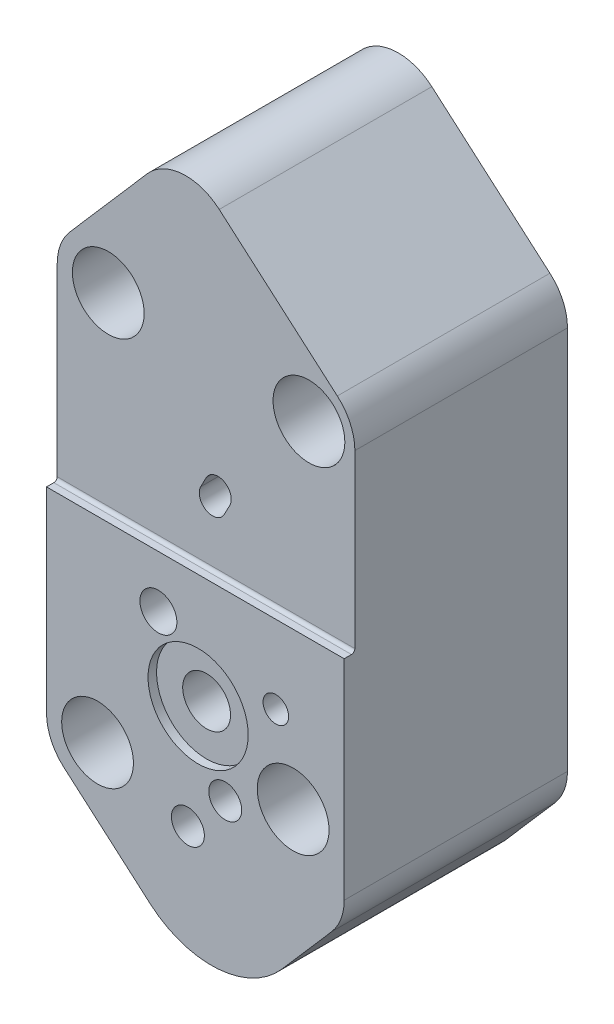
ISO-10303-21;
HEADER;
FILE_DESCRIPTION(('STEP AP214'),'2;1');
FILE_NAME('part.step','',(''),(''),'','','');
FILE_SCHEMA(('AUTOMOTIVE_DESIGN { 1 0 10303 214 1 1 1 1 }'));
ENDSEC;
DATA;
#1=APPLICATION_CONTEXT('core data for automotive mechanical design processes');
#2=APPLICATION_PROTOCOL_DEFINITION('international standard','automotive_design',2000,#1);
#3=PRODUCT_CONTEXT('',#1,'mechanical');
#4=PRODUCT('Part','Part','',(#3));
#5=PRODUCT_RELATED_PRODUCT_CATEGORY('part','',(#4));
#6=PRODUCT_DEFINITION_FORMATION('','',#4);
#7=PRODUCT_DEFINITION_CONTEXT('part definition',#1,'design');
#8=PRODUCT_DEFINITION('design','',#6,#7);
#9=PRODUCT_DEFINITION_SHAPE('','',#8);
#10=(LENGTH_UNIT() NAMED_UNIT(*) SI_UNIT(.MILLI.,.METRE.));
#11=(NAMED_UNIT(*) PLANE_ANGLE_UNIT() SI_UNIT($,.RADIAN.));
#12=(NAMED_UNIT(*) SI_UNIT($,.STERADIAN.) SOLID_ANGLE_UNIT());
#13=UNCERTAINTY_MEASURE_WITH_UNIT(LENGTH_MEASURE(1.E-05),#10,'distance_accuracy_value','');
#14=(GEOMETRIC_REPRESENTATION_CONTEXT(3) GLOBAL_UNCERTAINTY_ASSIGNED_CONTEXT((#13)) GLOBAL_UNIT_ASSIGNED_CONTEXT((#10,
#11,#12)) REPRESENTATION_CONTEXT('',''));
#15=CARTESIAN_POINT('',(0.,0.,0.));
#16=DIRECTION('',(0.,0.,1.));
#17=DIRECTION('',(1.,0.,0.));
#18=AXIS2_PLACEMENT_3D('',#15,#16,#17);
#19=CARTESIAN_POINT('',(-786.638,12.1965232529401,1.5998698));
#20=DIRECTION('',(0.,0.,-1.));
#21=DIRECTION('',(-1.,0.,0.));
#22=AXIS2_PLACEMENT_3D('',#19,#20,#21);
#23=CYLINDRICAL_SURFACE('',#22,7.61999999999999);
#24=CARTESIAN_POINT('',(-786.638,12.1965232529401,0.));
#25=DIRECTION('',(0.,0.,1.));
#26=DIRECTION('',(1.,0.,0.));
#27=AXIS2_PLACEMENT_3D('',#24,#25,#26);
#28=CIRCLE('',#27,7.61999999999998);
#29=CARTESIAN_POINT('',(-781.641641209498,17.9498526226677,0.));
#30=VERTEX_POINT('',#29);
#31=CARTESIAN_POINT('',(-779.018,12.1965232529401,0.));
#32=VERTEX_POINT('',#31);
#33=EDGE_CURVE('E385',#30,#32,#28,.F.);
#34=ORIENTED_EDGE('',*,*,#33,.T.);
#35=DIRECTION('',(0.,0.,-1.));
#36=VECTOR('',#35,1.);
#37=CARTESIAN_POINT('',(-779.018,12.1965232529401,1.5998698));
#38=LINE('',#37,#36);
#39=CARTESIAN_POINT('',(-779.018,12.1965232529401,-31.75));
#40=VERTEX_POINT('',#39);
#41=EDGE_CURVE('E247',#32,#40,#38,.T.);
#42=ORIENTED_EDGE('',*,*,#41,.T.);
#43=CARTESIAN_POINT('',(-786.638,12.1965232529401,-31.75));
#44=DIRECTION('',(0.,0.,1.));
#45=DIRECTION('',(1.,0.,0.));
#46=AXIS2_PLACEMENT_3D('',#43,#44,#45);
#47=CIRCLE('',#46,7.61999999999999);
#48=CARTESIAN_POINT('',(-781.641641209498,17.9498526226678,-31.75));
#49=VERTEX_POINT('',#48);
#50=EDGE_CURVE('E601',#40,#49,#47,.T.);
#51=ORIENTED_EDGE('',*,*,#50,.T.);
#52=DIRECTION('',(0.,0.,-1.));
#53=VECTOR('',#52,1.);
#54=CARTESIAN_POINT('',(-781.641641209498,17.9498526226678,1.5998698));
#55=LINE('',#54,#53);
#56=EDGE_CURVE('E244',#30,#49,#55,.T.);
#57=ORIENTED_EDGE('',*,*,#56,.F.);
#58=EDGE_LOOP('',(#34,#42,#51,#57));
#59=FACE_BOUND('',#58,.T.);
#60=ADVANCED_FACE('F51',(#59),#23,.T.);
#61=CARTESIAN_POINT('',(-799.2745235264,33.2627611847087,1.5998698));
#62=DIRECTION('',(-0.65569012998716,-0.755030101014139,0.));
#63=DIRECTION('',(0.755030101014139,-0.65569012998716,0.));
#64=AXIS2_PLACEMENT_3D('',#61,#62,#63);
#65=PLANE('',#64);
#66=DIRECTION('',(0.75503010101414,-0.65569012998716,0.));
#67=VECTOR('',#66,1.);
#68=CARTESIAN_POINT('',(-781.641641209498,17.9498526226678,0.));
#69=LINE('',#68,#67);
#70=CARTESIAN_POINT('',(-799.2745235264,33.2627611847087,0.));
#71=VERTEX_POINT('',#70);
#72=EDGE_CURVE('E389',#71,#30,#69,.T.);
#73=ORIENTED_EDGE('',*,*,#72,.T.);
#74=ORIENTED_EDGE('',*,*,#56,.T.);
#75=DIRECTION('',(-0.755030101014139,0.65569012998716,0.));
#76=VECTOR('',#75,1.);
#77=CARTESIAN_POINT('',(-799.2745235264,33.2627611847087,-31.75));
#78=LINE('',#77,#76);
#79=CARTESIAN_POINT('',(-799.2745235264,33.2627611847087,-31.75));
#80=VERTEX_POINT('',#79);
#81=EDGE_CURVE('E605',#49,#80,#78,.T.);
#82=ORIENTED_EDGE('',*,*,#81,.T.);
#83=DIRECTION('',(0.,0.,-1.));
#84=VECTOR('',#83,1.);
#85=CARTESIAN_POINT('',(-799.2745235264,33.2627611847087,1.5998698));
#86=LINE('',#85,#84);
#87=EDGE_CURVE('E241',#71,#80,#86,.T.);
#88=ORIENTED_EDGE('',*,*,#87,.F.);
#89=EDGE_LOOP('',(#73,#74,#82,#88));
#90=FACE_BOUND('',#89,.T.);
#91=ADVANCED_FACE('F545',(#90),#65,.F.);
#92=CARTESIAN_POINT('',(-804.270882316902,27.509431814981,1.5998698));
#93=DIRECTION('',(0.,0.,-1.));
#94=DIRECTION('',(-1.,0.,0.));
#95=AXIS2_PLACEMENT_3D('',#92,#93,#94);
#96=CYLINDRICAL_SURFACE('',#95,7.62);
#97=CARTESIAN_POINT('',(-804.270882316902,27.509431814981,0.));
#98=DIRECTION('',(0.,0.,1.));
#99=DIRECTION('',(1.,0.,0.));
#100=AXIS2_PLACEMENT_3D('',#97,#98,#99);
#101=CIRCLE('',#100,7.62);
#102=CARTESIAN_POINT('',(-810.02421168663,32.5057906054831,0.));
#103=VERTEX_POINT('',#102);
#104=EDGE_CURVE('E393',#103,#71,#101,.F.);
#105=ORIENTED_EDGE('',*,*,#104,.T.);
#106=ORIENTED_EDGE('',*,*,#87,.T.);
#107=CARTESIAN_POINT('',(-804.270882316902,27.509431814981,-31.75));
#108=DIRECTION('',(0.,0.,1.));
#109=DIRECTION('',(-1.,0.,0.));
#110=AXIS2_PLACEMENT_3D('',#107,#108,#109);
#111=CIRCLE('',#110,7.62);
#112=CARTESIAN_POINT('',(-810.02421168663,32.5057906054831,-31.75));
#113=VERTEX_POINT('',#112);
#114=EDGE_CURVE('E613',#80,#113,#111,.T.);
#115=ORIENTED_EDGE('',*,*,#114,.T.);
#116=DIRECTION('',(0.,0.,-1.));
#117=VECTOR('',#116,1.);
#118=CARTESIAN_POINT('',(-810.02421168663,32.5057906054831,1.5998698));
#119=LINE('',#118,#117);
#120=EDGE_CURVE('E238',#103,#113,#119,.T.);
#121=ORIENTED_EDGE('',*,*,#120,.F.);
#122=EDGE_LOOP('',(#105,#106,#115,#121));
#123=FACE_BOUND('',#122,.T.);
#124=ADVANCED_FACE('F552',(#123),#96,.T.);
#125=CARTESIAN_POINT('',(-810.02421168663,32.5057906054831,1.5998698));
#126=DIRECTION('',(0.75503010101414,-0.655690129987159,0.));
#127=DIRECTION('',(0.655690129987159,0.75503010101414,0.));
#128=AXIS2_PLACEMENT_3D('',#125,#126,#127);
#129=PLANE('',#128);
#130=DIRECTION('',(0.655690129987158,0.755030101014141,0.));
#131=VECTOR('',#130,1.);
#132=CARTESIAN_POINT('',(-810.02421168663,32.5057906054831,0.));
#133=LINE('',#132,#131);
#134=CARTESIAN_POINT('',(-821.601329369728,19.1746881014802,0.));
#135=VERTEX_POINT('',#134);
#136=EDGE_CURVE('E397',#135,#103,#133,.T.);
#137=ORIENTED_EDGE('',*,*,#136,.T.);
#138=ORIENTED_EDGE('',*,*,#120,.T.);
#139=DIRECTION('',(-0.655690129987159,-0.75503010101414,0.));
#140=VECTOR('',#139,1.);
#141=CARTESIAN_POINT('',(-810.02421168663,32.5057906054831,-31.75));
#142=LINE('',#141,#140);
#143=CARTESIAN_POINT('',(-821.601329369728,19.1746881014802,-31.75));
#144=VERTEX_POINT('',#143);
#145=EDGE_CURVE('E619',#113,#144,#142,.T.);
#146=ORIENTED_EDGE('',*,*,#145,.T.);
#147=DIRECTION('',(0.,0.,-1.));
#148=VECTOR('',#147,1.);
#149=CARTESIAN_POINT('',(-821.601329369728,19.1746881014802,1.5998698));
#150=LINE('',#149,#148);
#151=EDGE_CURVE('E235',#135,#144,#150,.T.);
#152=ORIENTED_EDGE('',*,*,#151,.F.);
#153=EDGE_LOOP('',(#137,#138,#146,#152));
#154=FACE_BOUND('',#153,.T.);
#155=ADVANCED_FACE('F727',(#154),#129,.F.);
#156=CARTESIAN_POINT('',(-815.848,14.178329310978,1.5998698));
#157=DIRECTION('',(0.,0.,-1.));
#158=DIRECTION('',(-1.,0.,0.));
#159=AXIS2_PLACEMENT_3D('',#156,#157,#158);
#160=CYLINDRICAL_SURFACE('',#159,7.61999999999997);
#161=CARTESIAN_POINT('',(-815.848,14.178329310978,0.));
#162=DIRECTION('',(0.,0.,1.));
#163=DIRECTION('',(1.,0.,0.));
#164=AXIS2_PLACEMENT_3D('',#161,#162,#163);
#165=CIRCLE('',#164,7.61999999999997);
#166=CARTESIAN_POINT('',(-823.468,14.178329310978,0.));
#167=VERTEX_POINT('',#166);
#168=EDGE_CURVE('E401',#167,#135,#165,.F.);
#169=ORIENTED_EDGE('',*,*,#168,.T.);
#170=ORIENTED_EDGE('',*,*,#151,.T.);
#171=CARTESIAN_POINT('',(-815.848,14.178329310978,-31.75));
#172=DIRECTION('',(0.,0.,1.));
#173=DIRECTION('',(-1.,0.,0.));
#174=AXIS2_PLACEMENT_3D('',#171,#172,#173);
#175=CIRCLE('',#174,7.61999999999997);
#176=CARTESIAN_POINT('',(-823.468,14.178329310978,-31.75));
#177=VERTEX_POINT('',#176);
#178=EDGE_CURVE('E628',#144,#177,#175,.T.);
#179=ORIENTED_EDGE('',*,*,#178,.T.);
#180=DIRECTION('',(0.,0.,-1.));
#181=VECTOR('',#180,1.);
#182=CARTESIAN_POINT('',(-823.468,14.178329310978,1.5998698));
#183=LINE('',#182,#181);
#184=EDGE_CURVE('E227',#167,#177,#183,.T.);
#185=ORIENTED_EDGE('',*,*,#184,.F.);
#186=EDGE_LOOP('',(#169,#170,#179,#185));
#187=FACE_BOUND('',#186,.T.);
#188=ADVANCED_FACE('F723',(#187),#160,.T.);
#189=CARTESIAN_POINT('',(-800.276606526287,-4.8861439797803,1.5998698));
#190=DIRECTION('',(0.,0.,-1.));
#191=DIRECTION('',(-1.,0.,0.));
#192=AXIS2_PLACEMENT_3D('',#189,#190,#191);
#193=CYLINDRICAL_SURFACE('',#192,1.98313999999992);
#194=DIRECTION('',(0.,0.,-1.));
#195=VECTOR('',#194,1.);
#196=CARTESIAN_POINT('',(-802.03634480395,-3.97172315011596,1.5998698));
#197=LINE('',#196,#195);
#198=CARTESIAN_POINT('',(-802.03634480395,-3.97172315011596,0.));
#199=VERTEX_POINT('',#198);
#200=CARTESIAN_POINT('',(-802.03634480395,-3.97172315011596,-6.35));
#201=VERTEX_POINT('',#200);
#202=EDGE_CURVE('E278',#199,#201,#197,.T.);
#203=ORIENTED_EDGE('',*,*,#202,.F.);
#204=CARTESIAN_POINT('',(-800.276606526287,-4.8861439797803,0.));
#205=DIRECTION('',(0.,0.,1.));
#206=DIRECTION('',(1.,0.,0.));
#207=AXIS2_PLACEMENT_3D('',#204,#205,#206);
#208=CIRCLE('',#207,1.98313999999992);
#209=CARTESIAN_POINT('',(-798.516868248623,-5.8005648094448,0.));
#210=VERTEX_POINT('',#209);
#211=EDGE_CURVE('E418',#199,#210,#208,.T.);
#212=ORIENTED_EDGE('',*,*,#211,.T.);
#213=DIRECTION('',(0.,0.,-1.));
#214=VECTOR('',#213,1.);
#215=CARTESIAN_POINT('',(-798.516868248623,-5.8005648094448,1.5998698));
#216=LINE('',#215,#214);
#217=CARTESIAN_POINT('',(-798.516868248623,-5.8005648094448,-6.35));
#218=VERTEX_POINT('',#217);
#219=EDGE_CURVE('E439',#210,#218,#216,.T.);
#220=ORIENTED_EDGE('',*,*,#219,.T.);
#221=CARTESIAN_POINT('',(-800.276606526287,-4.8861439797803,-6.35));
#222=DIRECTION('',(0.,0.,1.));
#223=DIRECTION('',(1.,0.,0.));
#224=AXIS2_PLACEMENT_3D('',#221,#222,#223);
#225=CIRCLE('',#224,1.98313999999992);
#226=EDGE_CURVE('E442',#201,#218,#225,.T.);
#227=ORIENTED_EDGE('',*,*,#226,.F.);
#228=EDGE_LOOP('',(#203,#212,#220,#227));
#229=FACE_BOUND('',#228,.T.);
#230=ADVANCED_FACE('F726',(#229),#193,.F.);
#231=CARTESIAN_POINT('',(-798.516868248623,-5.8005648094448,1.5998698));
#232=DIRECTION('',(-0.887349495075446,0.46109746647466,0.));
#233=DIRECTION('',(-0.46109746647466,-0.887349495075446,0.));
#234=AXIS2_PLACEMENT_3D('',#231,#232,#233);
#235=PLANE('',#234);
#236=ORIENTED_EDGE('',*,*,#219,.F.);
#237=DIRECTION('',(0.46109746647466,0.887349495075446,0.));
#238=VECTOR('',#237,1.);
#239=CARTESIAN_POINT('',(-798.516868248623,-5.8005648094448,0.));
#240=LINE('',#239,#238);
#241=CARTESIAN_POINT('',(-797.709947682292,-4.24770319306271,0.));
#242=VERTEX_POINT('',#241);
#243=EDGE_CURVE('E414',#210,#242,#240,.T.);
#244=ORIENTED_EDGE('',*,*,#243,.T.);
#245=DIRECTION('',(0.,0.,-1.));
#246=VECTOR('',#245,1.);
#247=CARTESIAN_POINT('',(-797.709947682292,-4.24770319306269,1.5998698));
#248=LINE('',#247,#246);
#249=CARTESIAN_POINT('',(-797.709947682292,-4.24770319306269,-6.35));
#250=VERTEX_POINT('',#249);
#251=EDGE_CURVE('E436',#242,#250,#248,.T.);
#252=ORIENTED_EDGE('',*,*,#251,.T.);
#253=DIRECTION('',(0.46109746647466,0.887349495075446,0.));
#254=VECTOR('',#253,1.);
#255=CARTESIAN_POINT('',(-798.516868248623,-5.8005648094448,-6.35));
#256=LINE('',#255,#254);
#257=EDGE_CURVE('E446',#218,#250,#256,.T.);
#258=ORIENTED_EDGE('',*,*,#257,.F.);
#259=EDGE_LOOP('',(#236,#244,#252,#258));
#260=FACE_BOUND('',#259,.T.);
#261=ADVANCED_FACE('F763',(#260),#235,.T.);
#262=CARTESIAN_POINT('',(-799.469685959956,-3.33328236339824,1.5998698));
#263=DIRECTION('',(0.,0.,-1.));
#264=DIRECTION('',(-1.,0.,0.));
#265=AXIS2_PLACEMENT_3D('',#262,#263,#264);
#266=CYLINDRICAL_SURFACE('',#265,1.98314000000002);
#267=ORIENTED_EDGE('',*,*,#251,.F.);
#268=CARTESIAN_POINT('',(-799.469685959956,-3.33328236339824,0.));
#269=DIRECTION('',(0.,0.,1.));
#270=DIRECTION('',(1.,0.,0.));
#271=AXIS2_PLACEMENT_3D('',#268,#269,#270);
#272=CIRCLE('',#271,1.98314000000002);
#273=CARTESIAN_POINT('',(-801.22942423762,-2.41886153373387,0.));
#274=VERTEX_POINT('',#273);
#275=EDGE_CURVE('E407',#242,#274,#272,.T.);
#276=ORIENTED_EDGE('',*,*,#275,.T.);
#277=DIRECTION('',(0.,0.,-1.));
#278=VECTOR('',#277,1.);
#279=CARTESIAN_POINT('',(-801.22942423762,-2.41886153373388,1.5998698));
#280=LINE('',#279,#278);
#281=CARTESIAN_POINT('',(-801.22942423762,-2.41886153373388,-6.35));
#282=VERTEX_POINT('',#281);
#283=EDGE_CURVE('E433',#274,#282,#280,.T.);
#284=ORIENTED_EDGE('',*,*,#283,.T.);
#285=CARTESIAN_POINT('',(-799.469685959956,-3.33328236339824,-6.35));
#286=DIRECTION('',(0.,0.,1.));
#287=DIRECTION('',(1.,0.,0.));
#288=AXIS2_PLACEMENT_3D('',#285,#286,#287);
#289=CIRCLE('',#288,1.98314000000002);
#290=EDGE_CURVE('E450',#250,#282,#289,.T.);
#291=ORIENTED_EDGE('',*,*,#290,.F.);
#292=EDGE_LOOP('',(#267,#276,#284,#291));
#293=FACE_BOUND('',#292,.T.);
#294=ADVANCED_FACE('F771',(#293),#266,.F.);
#295=CARTESIAN_POINT('',(-801.22942423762,-2.41886153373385,1.5998698));
#296=DIRECTION('',(0.887349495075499,-0.461097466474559,0.));
#297=DIRECTION('',(0.46109746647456,0.887349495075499,0.));
#298=AXIS2_PLACEMENT_3D('',#295,#296,#297);
#299=PLANE('',#298);
#300=ORIENTED_EDGE('',*,*,#283,.F.);
#301=DIRECTION('',(-0.46109746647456,-0.887349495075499,0.));
#302=VECTOR('',#301,1.);
#303=CARTESIAN_POINT('',(-801.22942423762,-2.41886153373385,0.));
#304=LINE('',#303,#302);
#305=EDGE_CURVE('E265',#274,#199,#304,.T.);
#306=ORIENTED_EDGE('',*,*,#305,.T.);
#307=ORIENTED_EDGE('',*,*,#202,.T.);
#308=DIRECTION('',(-0.461097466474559,-0.887349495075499,0.));
#309=VECTOR('',#308,1.);
#310=CARTESIAN_POINT('',(-801.22942423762,-2.41886153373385,-6.35));
#311=LINE('',#310,#309);
#312=EDGE_CURVE('E454',#282,#201,#311,.T.);
#313=ORIENTED_EDGE('',*,*,#312,.F.);
#314=EDGE_LOOP('',(#300,#306,#307,#313));
#315=FACE_BOUND('',#314,.T.);
#316=ADVANCED_FACE('F520',(#315),#299,.T.);
#317=CARTESIAN_POINT('',(-815.848,-43.1751649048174,1.5998698));
#318=DIRECTION('',(0.,0.,1.));
#319=DIRECTION('',(1.,0.,0.));
#320=AXIS2_PLACEMENT_3D('',#317,#318,#319);
#321=PLANE('',#320);
#322=CARTESIAN_POINT('',(-815.848,-43.1751649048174,1.5998698));
#323=DIRECTION('',(0.,0.,-1.));
#324=DIRECTION('',(-1.,0.,0.));
#325=AXIS2_PLACEMENT_3D('',#322,#323,#324);
#326=CIRCLE('',#325,5.3594);
#327=CARTESIAN_POINT('',(-821.2074,-43.1751649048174,1.5998698));
#328=VERTEX_POINT('',#327);
#329=EDGE_CURVE('E334',#328,#328,#326,.T.);
#330=ORIENTED_EDGE('',*,*,#329,.T.);
#331=EDGE_LOOP('',(#330));
#332=FACE_BOUND('',#331,.T.);
#333=CARTESIAN_POINT('',(-786.638,-37.2194709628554,1.5998698));
#334=DIRECTION('',(0.,0.,-1.));
#335=DIRECTION('',(-1.,0.,0.));
#336=AXIS2_PLACEMENT_3D('',#333,#334,#335);
#337=CIRCLE('',#336,5.3594);
#338=CARTESIAN_POINT('',(-791.9974,-37.2194709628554,1.5998698));
#339=VERTEX_POINT('',#338);
#340=EDGE_CURVE('E329',#339,#339,#337,.T.);
#341=ORIENTED_EDGE('',*,*,#340,.T.);
#342=EDGE_LOOP('',(#341));
#343=FACE_BOUND('',#342,.T.);
#344=DIRECTION('',(1.,0.,0.));
#345=VECTOR('',#344,1.);
#346=CARTESIAN_POINT('',(-823.468,-13.9178402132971,1.5998698));
#347=LINE('',#346,#345);
#348=CARTESIAN_POINT('',(-823.468,-13.9178402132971,1.5998698));
#349=VERTEX_POINT('',#348);
#350=CARTESIAN_POINT('',(-779.018,-13.9178402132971,1.5998698));
#351=VERTEX_POINT('',#350);
#352=EDGE_CURVE('E199',#349,#351,#347,.T.);
#353=ORIENTED_EDGE('',*,*,#352,.F.);
#354=DIRECTION('',(0.,-1.,0.));
#355=VECTOR('',#354,1.);
#356=CARTESIAN_POINT('',(-823.468,14.178329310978,1.5998698));
#357=LINE('',#356,#355);
#358=CARTESIAN_POINT('',(-823.468,-43.1751649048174,1.5998698));
#359=VERTEX_POINT('',#358);
#360=EDGE_CURVE('E211',#349,#359,#357,.T.);
#361=ORIENTED_EDGE('',*,*,#360,.T.);
#362=CARTESIAN_POINT('',(-815.848,-43.1751649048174,1.5998698));
#363=DIRECTION('',(0.,0.,1.));
#364=DIRECTION('',(1.,0.,0.));
#365=AXIS2_PLACEMENT_3D('',#362,#363,#364);
#366=CIRCLE('',#365,7.61999999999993);
#367=CARTESIAN_POINT('',(-820.844358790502,-48.9284942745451,1.5998698));
#368=VERTEX_POINT('',#367);
#369=EDGE_CURVE('E635',#359,#368,#366,.T.);
#370=ORIENTED_EDGE('',*,*,#369,.T.);
#371=DIRECTION('',(0.75503010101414,-0.655690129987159,0.));
#372=VECTOR('',#371,1.);
#373=CARTESIAN_POINT('',(-820.844358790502,-48.9284942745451,1.5998698));
#374=LINE('',#373,#372);
#375=CARTESIAN_POINT('',(-808.005917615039,-60.0777705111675,1.5998698));
#376=VERTEX_POINT('',#375);
#377=EDGE_CURVE('E638',#368,#376,#374,.T.);
#378=ORIENTED_EDGE('',*,*,#377,.T.);
#379=CARTESIAN_POINT('',(-798.845926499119,-49.53,1.5998698));
#380=DIRECTION('',(0.,0.,1.));
#381=DIRECTION('',(-1.,0.,0.));
#382=AXIS2_PLACEMENT_3D('',#379,#380,#381);
#383=CIRCLE('',#382,13.97);
#384=CARTESIAN_POINT('',(-788.298155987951,-58.6899911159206,1.5998698));
#385=VERTEX_POINT('',#384);
#386=EDGE_CURVE('E641',#376,#385,#383,.T.);
#387=ORIENTED_EDGE('',*,*,#386,.T.);
#388=DIRECTION('',(0.655690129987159,0.75503010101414,0.));
#389=VECTOR('',#388,1.);
#390=CARTESIAN_POINT('',(-780.884670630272,-50.1533297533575,1.5998698));
#391=LINE('',#390,#389);
#392=CARTESIAN_POINT('',(-780.884670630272,-50.1533297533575,1.5998698));
#393=VERTEX_POINT('',#392);
#394=EDGE_CURVE('E644',#385,#393,#391,.T.);
#395=ORIENTED_EDGE('',*,*,#394,.T.);
#396=CARTESIAN_POINT('',(-786.638,-45.1569709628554,1.5998698));
#397=DIRECTION('',(0.,0.,1.));
#398=DIRECTION('',(1.,0.,0.));
#399=AXIS2_PLACEMENT_3D('',#396,#397,#398);
#400=CIRCLE('',#399,7.61999999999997);
#401=CARTESIAN_POINT('',(-779.018,-45.1569709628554,1.5998698));
#402=VERTEX_POINT('',#401);
#403=EDGE_CURVE('E229',#393,#402,#400,.T.);
#404=ORIENTED_EDGE('',*,*,#403,.T.);
#405=DIRECTION('',(0.,1.,0.));
#406=VECTOR('',#405,1.);
#407=CARTESIAN_POINT('',(-779.018,12.1965232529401,1.5998698));
#408=LINE('',#407,#406);
#409=EDGE_CURVE('E214',#402,#351,#408,.T.);
#410=ORIENTED_EDGE('',*,*,#409,.T.);
#411=EDGE_LOOP('',(#353,#361,#370,#378,#387,#395,#404,#410));
#412=FACE_BOUND('',#411,.T.);
#413=CARTESIAN_POINT('',(-800.829795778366,-30.9504062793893,1.5998698));
#414=DIRECTION('',(0.,0.,1.));
#415=DIRECTION('',(1.,0.,0.));
#416=AXIS2_PLACEMENT_3D('',#413,#414,#415);
#417=CIRCLE('',#416,7.477125);
#418=CARTESIAN_POINT('',(-793.352670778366,-30.9504062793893,1.5998698));
#419=VERTEX_POINT('',#418);
#420=EDGE_CURVE('E274',#419,#419,#417,.T.);
#421=ORIENTED_EDGE('',*,*,#420,.F.);
#422=EDGE_LOOP('',(#421));
#423=FACE_BOUND('',#422,.T.);
#424=CARTESIAN_POINT('',(-796.778000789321,-41.1769872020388,1.5998698));
#425=DIRECTION('',(0.,0.,1.));
#426=DIRECTION('',(1.,0.,0.));
#427=AXIS2_PLACEMENT_3D('',#424,#425,#426);
#428=CIRCLE('',#427,2.45872000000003);
#429=CARTESIAN_POINT('',(-794.319280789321,-41.1769872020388,1.5998698));
#430=VERTEX_POINT('',#429);
#431=EDGE_CURVE('E292',#430,#430,#428,.T.);
#432=ORIENTED_EDGE('',*,*,#431,.F.);
#433=EDGE_LOOP('',(#432));
#434=FACE_BOUND('',#433,.T.);
#435=CARTESIAN_POINT('',(-802.354782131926,-47.2412554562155,1.5998698));
#436=DIRECTION('',(0.,0.,1.));
#437=DIRECTION('',(1.,0.,0.));
#438=AXIS2_PLACEMENT_3D('',#435,#436,#437);
#439=CIRCLE('',#438,2.45872000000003);
#440=CARTESIAN_POINT('',(-799.896062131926,-47.2412554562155,1.5998698));
#441=VERTEX_POINT('',#440);
#442=EDGE_CURVE('E317',#441,#441,#439,.T.);
#443=ORIENTED_EDGE('',*,*,#442,.F.);
#444=EDGE_LOOP('',(#443));
#445=FACE_BOUND('',#444,.T.);
#446=CARTESIAN_POINT('',(-789.220778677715,-25.5532134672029,1.5998698));
#447=DIRECTION('',(0.,0.,1.));
#448=DIRECTION('',(1.,0.,0.));
#449=AXIS2_PLACEMENT_3D('',#446,#447,#448);
#450=CIRCLE('',#449,1.90754000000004);
#451=CARTESIAN_POINT('',(-787.313238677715,-25.5532134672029,1.5998698));
#452=VERTEX_POINT('',#451);
#453=EDGE_CURVE('E497',#452,#452,#450,.T.);
#454=ORIENTED_EDGE('',*,*,#453,.F.);
#455=EDGE_LOOP('',(#454));
#456=FACE_BOUND('',#455,.T.);
#457=CARTESIAN_POINT('',(-806.760388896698,-21.6860625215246,1.5998698));
#458=DIRECTION('',(0.,0.,1.));
#459=DIRECTION('',(1.,0.,0.));
#460=AXIS2_PLACEMENT_3D('',#457,#458,#459);
#461=CIRCLE('',#460,2.75844000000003);
#462=CARTESIAN_POINT('',(-804.001948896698,-21.6860625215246,1.5998698));
#463=VERTEX_POINT('',#462);
#464=EDGE_CURVE('E478',#463,#463,#461,.T.);
#465=ORIENTED_EDGE('',*,*,#464,.F.);
#466=EDGE_LOOP('',(#465));
#467=FACE_BOUND('',#466,.T.);
#468=ADVANCED_FACE('F208',(#332,#343,#412,#423,#434,#445,#456,#467),#321,.T.);
#469=CARTESIAN_POINT('',(-815.848,-43.1751649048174,1.5998698));
#470=DIRECTION('',(0.,0.,-1.));
#471=DIRECTION('',(-1.,0.,0.));
#472=AXIS2_PLACEMENT_3D('',#469,#470,#471);
#473=CYLINDRICAL_SURFACE('',#472,7.61999999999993);
#474=DIRECTION('',(0.,0.,-1.));
#475=VECTOR('',#474,1.);
#476=CARTESIAN_POINT('',(-823.468,-43.1751649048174,1.5998698));
#477=LINE('',#476,#475);
#478=CARTESIAN_POINT('',(-823.468,-43.1751649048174,-31.75));
#479=VERTEX_POINT('',#478);
#480=EDGE_CURVE('E220',#359,#479,#477,.T.);
#481=ORIENTED_EDGE('',*,*,#480,.T.);
#482=CARTESIAN_POINT('',(-815.848,-43.1751649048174,-31.75));
#483=DIRECTION('',(0.,0.,1.));
#484=DIRECTION('',(1.,0.,0.));
#485=AXIS2_PLACEMENT_3D('',#482,#483,#484);
#486=CIRCLE('',#485,7.61999999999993);
#487=CARTESIAN_POINT('',(-820.844358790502,-48.9284942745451,-31.75));
#488=VERTEX_POINT('',#487);
#489=EDGE_CURVE('E673',#479,#488,#486,.T.);
#490=ORIENTED_EDGE('',*,*,#489,.T.);
#491=DIRECTION('',(0.,0.,-1.));
#492=VECTOR('',#491,1.);
#493=CARTESIAN_POINT('',(-820.844358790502,-48.9284942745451,1.5998698));
#494=LINE('',#493,#492);
#495=EDGE_CURVE('E262',#368,#488,#494,.T.);
#496=ORIENTED_EDGE('',*,*,#495,.F.);
#497=ORIENTED_EDGE('',*,*,#369,.F.);
#498=EDGE_LOOP('',(#481,#490,#496,#497));
#499=FACE_BOUND('',#498,.T.);
#500=ADVANCED_FACE('F519',(#499),#473,.T.);
#501=CARTESIAN_POINT('',(-820.844358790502,-48.9284942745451,1.5998698));
#502=DIRECTION('',(0.655690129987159,0.75503010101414,0.));
#503=DIRECTION('',(-0.75503010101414,0.655690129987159,0.));
#504=AXIS2_PLACEMENT_3D('',#501,#502,#503);
#505=PLANE('',#504);
#506=ORIENTED_EDGE('',*,*,#495,.T.);
#507=DIRECTION('',(0.75503010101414,-0.655690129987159,0.));
#508=VECTOR('',#507,1.);
#509=CARTESIAN_POINT('',(-820.844358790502,-48.9284942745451,-31.75));
#510=LINE('',#509,#508);
#511=CARTESIAN_POINT('',(-808.005917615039,-60.0777705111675,-31.75));
#512=VERTEX_POINT('',#511);
#513=EDGE_CURVE('E669',#488,#512,#510,.T.);
#514=ORIENTED_EDGE('',*,*,#513,.T.);
#515=DIRECTION('',(0.,0.,-1.));
#516=VECTOR('',#515,1.);
#517=CARTESIAN_POINT('',(-808.005917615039,-60.0777705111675,1.5998698));
#518=LINE('',#517,#516);
#519=EDGE_CURVE('E259',#376,#512,#518,.T.);
#520=ORIENTED_EDGE('',*,*,#519,.F.);
#521=ORIENTED_EDGE('',*,*,#377,.F.);
#522=EDGE_LOOP('',(#506,#514,#520,#521));
#523=FACE_BOUND('',#522,.T.);
#524=ADVANCED_FACE('F572',(#523),#505,.F.);
#525=CARTESIAN_POINT('',(-798.845926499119,-49.53,1.5998698));
#526=DIRECTION('',(0.,0.,-1.));
#527=DIRECTION('',(-1.,0.,0.));
#528=AXIS2_PLACEMENT_3D('',#525,#526,#527);
#529=CYLINDRICAL_SURFACE('',#528,13.97);
#530=ORIENTED_EDGE('',*,*,#519,.T.);
#531=CARTESIAN_POINT('',(-798.845926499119,-49.53,-31.75));
#532=DIRECTION('',(0.,0.,1.));
#533=DIRECTION('',(-1.,0.,0.));
#534=AXIS2_PLACEMENT_3D('',#531,#532,#533);
#535=CIRCLE('',#534,13.97);
#536=CARTESIAN_POINT('',(-788.298155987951,-58.6899911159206,-31.75));
#537=VERTEX_POINT('',#536);
#538=EDGE_CURVE('E665',#512,#537,#535,.T.);
#539=ORIENTED_EDGE('',*,*,#538,.T.);
#540=DIRECTION('',(0.,0.,-1.));
#541=VECTOR('',#540,1.);
#542=CARTESIAN_POINT('',(-788.298155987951,-58.6899911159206,1.5998698));
#543=LINE('',#542,#541);
#544=EDGE_CURVE('E256',#385,#537,#543,.T.);
#545=ORIENTED_EDGE('',*,*,#544,.F.);
#546=ORIENTED_EDGE('',*,*,#386,.F.);
#547=EDGE_LOOP('',(#530,#539,#545,#546));
#548=FACE_BOUND('',#547,.T.);
#549=ADVANCED_FACE('F568',(#548),#529,.T.);
#550=CARTESIAN_POINT('',(-780.884670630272,-50.1533297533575,1.5998698));
#551=DIRECTION('',(-0.75503010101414,0.655690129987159,0.));
#552=DIRECTION('',(-0.655690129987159,-0.75503010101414,0.));
#553=AXIS2_PLACEMENT_3D('',#550,#551,#552);
#554=PLANE('',#553);
#555=ORIENTED_EDGE('',*,*,#544,.T.);
#556=DIRECTION('',(0.655690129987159,0.75503010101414,0.));
#557=VECTOR('',#556,1.);
#558=CARTESIAN_POINT('',(-780.884670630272,-50.1533297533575,-31.75));
#559=LINE('',#558,#557);
#560=CARTESIAN_POINT('',(-780.884670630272,-50.1533297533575,-31.75));
#561=VERTEX_POINT('',#560);
#562=EDGE_CURVE('E660',#537,#561,#559,.T.);
#563=ORIENTED_EDGE('',*,*,#562,.T.);
#564=DIRECTION('',(0.,0.,-1.));
#565=VECTOR('',#564,1.);
#566=CARTESIAN_POINT('',(-780.884670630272,-50.1533297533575,1.5998698));
#567=LINE('',#566,#565);
#568=EDGE_CURVE('E253',#393,#561,#567,.T.);
#569=ORIENTED_EDGE('',*,*,#568,.F.);
#570=ORIENTED_EDGE('',*,*,#394,.F.);
#571=EDGE_LOOP('',(#555,#563,#569,#570));
#572=FACE_BOUND('',#571,.T.);
#573=ADVANCED_FACE('F564',(#572),#554,.F.);
#574=CARTESIAN_POINT('',(-786.638,-45.1569709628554,1.5998698));
#575=DIRECTION('',(0.,0.,-1.));
#576=DIRECTION('',(-1.,0.,0.));
#577=AXIS2_PLACEMENT_3D('',#574,#575,#576);
#578=CYLINDRICAL_SURFACE('',#577,7.61999999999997);
#579=ORIENTED_EDGE('',*,*,#568,.T.);
#580=CARTESIAN_POINT('',(-786.638,-45.1569709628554,-31.75));
#581=DIRECTION('',(0.,0.,1.));
#582=DIRECTION('',(1.,0.,0.));
#583=AXIS2_PLACEMENT_3D('',#580,#581,#582);
#584=CIRCLE('',#583,7.61999999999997);
#585=CARTESIAN_POINT('',(-779.018,-45.1569709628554,-31.75));
#586=VERTEX_POINT('',#585);
#587=EDGE_CURVE('E654',#561,#586,#584,.T.);
#588=ORIENTED_EDGE('',*,*,#587,.T.);
#589=DIRECTION('',(0.,0.,-1.));
#590=VECTOR('',#589,1.);
#591=CARTESIAN_POINT('',(-779.018,-45.1569709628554,1.5998698));
#592=LINE('',#591,#590);
#593=EDGE_CURVE('E250',#402,#586,#592,.T.);
#594=ORIENTED_EDGE('',*,*,#593,.F.);
#595=ORIENTED_EDGE('',*,*,#403,.F.);
#596=EDGE_LOOP('',(#579,#588,#594,#595));
#597=FACE_BOUND('',#596,.T.);
#598=ADVANCED_FACE('F560',(#597),#578,.T.);
#599=CARTESIAN_POINT('',(-779.018,12.1965232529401,1.5998698));
#600=DIRECTION('',(-1.,0.,0.));
#601=DIRECTION('',(0.,0.,1.));
#602=AXIS2_PLACEMENT_3D('',#599,#600,#601);
#603=PLANE('',#602);
#604=DIRECTION('',(0.,-1.,0.));
#605=VECTOR('',#604,1.);
#606=CARTESIAN_POINT('',(-779.018,-13.9178402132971,0.));
#607=LINE('',#606,#605);
#608=CARTESIAN_POINT('',(-779.018,-13.4098402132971,0.));
#609=VERTEX_POINT('',#608);
#610=EDGE_CURVE('E382',#32,#609,#607,.T.);
#611=ORIENTED_EDGE('',*,*,#610,.T.);
#612=CARTESIAN_POINT('',(-779.018,-13.4098402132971,0.507999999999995));
#613=DIRECTION('',(-1.,0.,0.));
#614=DIRECTION('',(0.,0.,1.));
#615=AXIS2_PLACEMENT_3D('',#612,#613,#614);
#616=CIRCLE('',#615,0.508);
#617=CARTESIAN_POINT('',(-779.018,-13.9178402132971,0.507999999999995));
#618=VERTEX_POINT('',#617);
#619=EDGE_CURVE('E14',#609,#618,#616,.T.);
#620=ORIENTED_EDGE('',*,*,#619,.T.);
#621=DIRECTION('',(0.,0.,1.));
#622=VECTOR('',#621,1.);
#623=CARTESIAN_POINT('',(-779.018,-13.9178402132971,-97.9424270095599));
#624=LINE('',#623,#622);
#625=EDGE_CURVE('E205',#618,#351,#624,.T.);
#626=ORIENTED_EDGE('',*,*,#625,.T.);
#627=ORIENTED_EDGE('',*,*,#409,.F.);
#628=ORIENTED_EDGE('',*,*,#593,.T.);
#629=DIRECTION('',(0.,1.,0.));
#630=VECTOR('',#629,1.);
#631=CARTESIAN_POINT('',(-779.018,12.1965232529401,-31.75));
#632=LINE('',#631,#630);
#633=EDGE_CURVE('E621',#586,#40,#632,.T.);
#634=ORIENTED_EDGE('',*,*,#633,.T.);
#635=ORIENTED_EDGE('',*,*,#41,.F.);
#636=EDGE_LOOP('',(#611,#620,#626,#627,#628,#634,#635));
#637=FACE_BOUND('',#636,.T.);
#638=ADVANCED_FACE('F557',(#637),#603,.F.);
#639=CARTESIAN_POINT('',(-823.468,14.178329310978,1.5998698));
#640=DIRECTION('',(1.,0.,0.));
#641=DIRECTION('',(0.,0.,-1.));
#642=AXIS2_PLACEMENT_3D('',#639,#640,#641);
#643=PLANE('',#642);
#644=ORIENTED_EDGE('',*,*,#360,.F.);
#645=DIRECTION('',(0.,0.,1.));
#646=VECTOR('',#645,1.);
#647=CARTESIAN_POINT('',(-823.468,-13.9178402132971,-97.9424270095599));
#648=LINE('',#647,#646);
#649=CARTESIAN_POINT('',(-823.468,-13.9178402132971,0.507999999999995));
#650=VERTEX_POINT('',#649);
#651=EDGE_CURVE('E195',#650,#349,#648,.T.);
#652=ORIENTED_EDGE('',*,*,#651,.F.);
#653=CARTESIAN_POINT('',(-823.468,-13.4098402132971,0.507999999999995));
#654=DIRECTION('',(1.,0.,0.));
#655=DIRECTION('',(0.,0.,-1.));
#656=AXIS2_PLACEMENT_3D('',#653,#654,#655);
#657=CIRCLE('',#656,0.508);
#658=CARTESIAN_POINT('',(-823.468,-13.4098402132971,0.));
#659=VERTEX_POINT('',#658);
#660=EDGE_CURVE('E61',#650,#659,#657,.T.);
#661=ORIENTED_EDGE('',*,*,#660,.T.);
#662=DIRECTION('',(0.,1.,0.));
#663=VECTOR('',#662,1.);
#664=CARTESIAN_POINT('',(-823.468,14.178329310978,0.));
#665=LINE('',#664,#663);
#666=EDGE_CURVE('E405',#659,#167,#665,.T.);
#667=ORIENTED_EDGE('',*,*,#666,.T.);
#668=ORIENTED_EDGE('',*,*,#184,.T.);
#669=DIRECTION('',(0.,-1.,0.));
#670=VECTOR('',#669,1.);
#671=CARTESIAN_POINT('',(-823.468,14.178329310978,-31.75));
#672=LINE('',#671,#670);
#673=EDGE_CURVE('E632',#177,#479,#672,.T.);
#674=ORIENTED_EDGE('',*,*,#673,.T.);
#675=ORIENTED_EDGE('',*,*,#480,.F.);
#676=EDGE_LOOP('',(#644,#652,#661,#667,#668,#674,#675));
#677=FACE_BOUND('',#676,.T.);
#678=ADVANCED_FACE('F218',(#677),#643,.F.);
#679=CARTESIAN_POINT('',(-815.848,-43.1751649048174,-31.75));
#680=DIRECTION('',(0.,0.,1.));
#681=DIRECTION('',(1.,0.,0.));
#682=AXIS2_PLACEMENT_3D('',#679,#680,#681);
#683=PLANE('',#682);
#684=CARTESIAN_POINT('',(-815.848,14.178329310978,-31.75));
#685=DIRECTION('',(0.,0.,1.));
#686=DIRECTION('',(1.,0.,0.));
#687=AXIS2_PLACEMENT_3D('',#684,#685,#686);
#688=CIRCLE('',#687,3.56869999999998);
#689=CARTESIAN_POINT('',(-812.2793,14.178329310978,-31.75));
#690=VERTEX_POINT('',#689);
#691=EDGE_CURVE('E336',#690,#690,#688,.T.);
#692=ORIENTED_EDGE('',*,*,#691,.T.);
#693=EDGE_LOOP('',(#692));
#694=FACE_BOUND('',#693,.T.);
#695=CARTESIAN_POINT('',(-785.876,12.5440115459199,-31.75));
#696=DIRECTION('',(0.,0.,1.));
#697=DIRECTION('',(1.,0.,0.));
#698=AXIS2_PLACEMENT_3D('',#695,#696,#697);
#699=CIRCLE('',#698,3.56869999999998);
#700=CARTESIAN_POINT('',(-782.3073,12.5440115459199,-31.75));
#701=VERTEX_POINT('',#700);
#702=EDGE_CURVE('E1217',#701,#701,#699,.T.);
#703=ORIENTED_EDGE('',*,*,#702,.T.);
#704=EDGE_LOOP('',(#703));
#705=FACE_BOUND('',#704,.T.);
#706=CARTESIAN_POINT('',(-786.638,-37.2194709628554,-31.75));
#707=DIRECTION('',(0.,0.,1.));
#708=DIRECTION('',(1.,0.,0.));
#709=AXIS2_PLACEMENT_3D('',#706,#707,#708);
#710=CIRCLE('',#709,3.56869999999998);
#711=CARTESIAN_POINT('',(-783.0693,-37.2194709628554,-31.75));
#712=VERTEX_POINT('',#711);
#713=EDGE_CURVE('E349',#712,#712,#710,.T.);
#714=ORIENTED_EDGE('',*,*,#713,.T.);
#715=EDGE_LOOP('',(#714));
#716=FACE_BOUND('',#715,.T.);
#717=CARTESIAN_POINT('',(-815.848,-43.1751649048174,-31.75));
#718=DIRECTION('',(0.,0.,1.));
#719=DIRECTION('',(1.,0.,0.));
#720=AXIS2_PLACEMENT_3D('',#717,#718,#719);
#721=CIRCLE('',#720,3.56869999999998);
#722=CARTESIAN_POINT('',(-812.2793,-43.1751649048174,-31.75));
#723=VERTEX_POINT('',#722);
#724=EDGE_CURVE('E365',#723,#723,#721,.T.);
#725=ORIENTED_EDGE('',*,*,#724,.T.);
#726=EDGE_LOOP('',(#725));
#727=FACE_BOUND('',#726,.T.);
#728=CARTESIAN_POINT('',(-800.829795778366,-30.9504062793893,-31.75));
#729=DIRECTION('',(0.,0.,1.));
#730=DIRECTION('',(1.,0.,0.));
#731=AXIS2_PLACEMENT_3D('',#728,#729,#730);
#732=CIRCLE('',#731,3.571875);
#733=CARTESIAN_POINT('',(-797.257920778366,-30.9504062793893,-31.75));
#734=VERTEX_POINT('',#733);
#735=EDGE_CURVE('E422',#734,#734,#732,.T.);
#736=ORIENTED_EDGE('',*,*,#735,.T.);
#737=EDGE_LOOP('',(#736));
#738=FACE_BOUND('',#737,.T.);
#739=DIRECTION('',(-0.461097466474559,-0.887349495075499,0.));
#740=VECTOR('',#739,1.);
#741=CARTESIAN_POINT('',(-802.233036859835,-3.86951515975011,-31.75));
#742=LINE('',#741,#740);
#743=CARTESIAN_POINT('',(-801.426116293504,-2.31665354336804,-31.75));
#744=VERTEX_POINT('',#743);
#745=CARTESIAN_POINT('',(-802.233036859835,-3.8695151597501,-31.75));
#746=VERTEX_POINT('',#745);
#747=EDGE_CURVE('E463',#744,#746,#742,.T.);
#748=ORIENTED_EDGE('',*,*,#747,.T.);
#749=CARTESIAN_POINT('',(-800.276606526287,-4.8861439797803,-31.75));
#750=DIRECTION('',(0.,0.,1.));
#751=DIRECTION('',(1.,0.,0.));
#752=AXIS2_PLACEMENT_3D('',#749,#750,#751);
#753=CIRCLE('',#752,2.20480244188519);
#754=CARTESIAN_POINT('',(-798.320176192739,-5.9027727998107,-31.75));
#755=VERTEX_POINT('',#754);
#756=EDGE_CURVE('E458',#746,#755,#753,.T.);
#757=ORIENTED_EDGE('',*,*,#756,.T.);
#758=DIRECTION('',(0.46109746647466,0.887349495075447,0.));
#759=VECTOR('',#758,1.);
#760=CARTESIAN_POINT('',(-798.320176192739,-5.9027727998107,-31.75));
#761=LINE('',#760,#759);
#762=CARTESIAN_POINT('',(-797.513255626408,-4.34991118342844,-31.75));
#763=VERTEX_POINT('',#762);
#764=EDGE_CURVE('E462',#755,#763,#761,.T.);
#765=ORIENTED_EDGE('',*,*,#764,.T.);
#766=CARTESIAN_POINT('',(-799.469685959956,-3.33328236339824,-31.75));
#767=DIRECTION('',(0.,0.,1.));
#768=DIRECTION('',(1.,0.,0.));
#769=AXIS2_PLACEMENT_3D('',#766,#767,#768);
#770=CIRCLE('',#769,2.20480244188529);
#771=EDGE_CURVE('E468',#763,#744,#770,.T.);
#772=ORIENTED_EDGE('',*,*,#771,.T.);
#773=EDGE_LOOP('',(#748,#757,#765,#772));
#774=FACE_BOUND('',#773,.T.);
#775=CARTESIAN_POINT('',(-806.760388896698,-21.6860625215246,-31.75));
#776=DIRECTION('',(0.,0.,1.));
#777=DIRECTION('',(1.,0.,0.));
#778=AXIS2_PLACEMENT_3D('',#775,#776,#777);
#779=CIRCLE('',#778,2.99406429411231);
#780=CARTESIAN_POINT('',(-803.766324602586,-21.6860625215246,-31.75));
#781=VERTEX_POINT('',#780);
#782=EDGE_CURVE('E492',#781,#781,#779,.T.);
#783=ORIENTED_EDGE('',*,*,#782,.T.);
#784=EDGE_LOOP('',(#783));
#785=FACE_BOUND('',#784,.T.);
#786=CARTESIAN_POINT('',(-789.220778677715,-25.5532134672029,-31.75));
#787=DIRECTION('',(0.,0.,1.));
#788=DIRECTION('',(1.,0.,0.));
#789=AXIS2_PLACEMENT_3D('',#786,#787,#788);
#790=CIRCLE('',#789,2.14316429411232);
#791=CARTESIAN_POINT('',(-787.077614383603,-25.5532134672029,-31.75));
#792=VERTEX_POINT('',#791);
#793=EDGE_CURVE('E322',#792,#792,#790,.T.);
#794=ORIENTED_EDGE('',*,*,#793,.T.);
#795=EDGE_LOOP('',(#794));
#796=FACE_BOUND('',#795,.T.);
#797=CARTESIAN_POINT('',(-802.354782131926,-47.2412554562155,-31.75));
#798=DIRECTION('',(0.,0.,1.));
#799=DIRECTION('',(1.,0.,0.));
#800=AXIS2_PLACEMENT_3D('',#797,#798,#799);
#801=CIRCLE('',#800,2.69434429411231);
#802=CARTESIAN_POINT('',(-799.660437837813,-47.2412554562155,-31.75));
#803=VERTEX_POINT('',#802);
#804=EDGE_CURVE('E299',#803,#803,#801,.T.);
#805=ORIENTED_EDGE('',*,*,#804,.T.);
#806=EDGE_LOOP('',(#805));
#807=FACE_BOUND('',#806,.T.);
#808=CARTESIAN_POINT('',(-796.778000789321,-41.1769872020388,-31.75));
#809=DIRECTION('',(0.,0.,1.));
#810=DIRECTION('',(1.,0.,0.));
#811=AXIS2_PLACEMENT_3D('',#808,#809,#810);
#812=CIRCLE('',#811,2.69434429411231);
#813=CARTESIAN_POINT('',(-794.083656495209,-41.1769872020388,-31.75));
#814=VERTEX_POINT('',#813);
#815=EDGE_CURVE('E676',#814,#814,#812,.T.);
#816=ORIENTED_EDGE('',*,*,#815,.T.);
#817=EDGE_LOOP('',(#816));
#818=FACE_BOUND('',#817,.T.);
#819=ORIENTED_EDGE('',*,*,#489,.F.);
#820=ORIENTED_EDGE('',*,*,#673,.F.);
#821=ORIENTED_EDGE('',*,*,#178,.F.);
#822=ORIENTED_EDGE('',*,*,#145,.F.);
#823=ORIENTED_EDGE('',*,*,#114,.F.);
#824=ORIENTED_EDGE('',*,*,#81,.F.);
#825=ORIENTED_EDGE('',*,*,#50,.F.);
#826=ORIENTED_EDGE('',*,*,#633,.F.);
#827=ORIENTED_EDGE('',*,*,#587,.F.);
#828=ORIENTED_EDGE('',*,*,#562,.F.);
#829=ORIENTED_EDGE('',*,*,#538,.F.);
#830=ORIENTED_EDGE('',*,*,#513,.F.);
#831=EDGE_LOOP('',(#819,#820,#821,#822,#823,#824,#825,#826,#827,#828,#829,#830));
#832=FACE_BOUND('',#831,.T.);
#833=ADVANCED_FACE('F609',(#694,#705,#716,#727,#738,#774,#785,#796,#807,#818,#832),#683,.F.);
#834=CARTESIAN_POINT('',(-796.778000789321,-41.1769872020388,-4.7501302));
#835=DIRECTION('',(0.,0.,-1.));
#836=DIRECTION('',(-1.,0.,0.));
#837=AXIS2_PLACEMENT_3D('',#834,#835,#836);
#838=CONICAL_SURFACE('',#837,2.45872000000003,0.00872664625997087);
#839=ORIENTED_EDGE('',*,*,#815,.F.);
#840=EDGE_LOOP('',(#839));
#841=FACE_BOUND('',#840,.T.);
#842=CARTESIAN_POINT('',(-796.778000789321,-41.1769872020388,-4.7501302));
#843=DIRECTION('',(0.,0.,1.));
#844=DIRECTION('',(1.,0.,0.));
#845=AXIS2_PLACEMENT_3D('',#842,#843,#844);
#846=CIRCLE('',#845,2.45872000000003);
#847=CARTESIAN_POINT('',(-794.319280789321,-41.1769872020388,-4.7501302));
#848=VERTEX_POINT('',#847);
#849=EDGE_CURVE('E298',#848,#848,#846,.T.);
#850=ORIENTED_EDGE('',*,*,#849,.T.);
#851=EDGE_LOOP('',(#850));
#852=FACE_BOUND('',#851,.T.);
#853=ADVANCED_FACE('F688',(#841,#852),#838,.F.);
#854=CARTESIAN_POINT('',(-796.778000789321,-41.1769872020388,1.5998698));
#855=DIRECTION('',(0.,0.,1.));
#856=DIRECTION('',(1.,0.,0.));
#857=AXIS2_PLACEMENT_3D('',#854,#855,#856);
#858=CYLINDRICAL_SURFACE('',#857,2.45872000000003);
#859=ORIENTED_EDGE('',*,*,#849,.F.);
#860=EDGE_LOOP('',(#859));
#861=FACE_BOUND('',#860,.T.);
#862=ORIENTED_EDGE('',*,*,#431,.T.);
#863=EDGE_LOOP('',(#862));
#864=FACE_BOUND('',#863,.T.);
#865=ADVANCED_FACE('F690',(#861,#864),#858,.F.);
#866=CARTESIAN_POINT('',(-802.354782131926,-47.2412554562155,-4.7501302));
#867=DIRECTION('',(0.,0.,-1.));
#868=DIRECTION('',(-1.,0.,0.));
#869=AXIS2_PLACEMENT_3D('',#866,#867,#868);
#870=CONICAL_SURFACE('',#869,2.45872000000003,0.00872664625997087);
#871=ORIENTED_EDGE('',*,*,#804,.F.);
#872=EDGE_LOOP('',(#871));
#873=FACE_BOUND('',#872,.T.);
#874=CARTESIAN_POINT('',(-802.354782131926,-47.2412554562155,-4.7501302));
#875=DIRECTION('',(0.,0.,1.));
#876=DIRECTION('',(1.,0.,0.));
#877=AXIS2_PLACEMENT_3D('',#874,#875,#876);
#878=CIRCLE('',#877,2.45872000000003);
#879=CARTESIAN_POINT('',(-799.896062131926,-47.2412554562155,-4.7501302));
#880=VERTEX_POINT('',#879);
#881=EDGE_CURVE('E313',#880,#880,#878,.T.);
#882=ORIENTED_EDGE('',*,*,#881,.T.);
#883=EDGE_LOOP('',(#882));
#884=FACE_BOUND('',#883,.T.);
#885=ADVANCED_FACE('F693',(#873,#884),#870,.F.);
#886=CARTESIAN_POINT('',(-802.354782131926,-47.2412554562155,1.5998698));
#887=DIRECTION('',(0.,0.,1.));
#888=DIRECTION('',(1.,0.,0.));
#889=AXIS2_PLACEMENT_3D('',#886,#887,#888);
#890=CYLINDRICAL_SURFACE('',#889,2.45872000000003);
#891=ORIENTED_EDGE('',*,*,#881,.F.);
#892=EDGE_LOOP('',(#891));
#893=FACE_BOUND('',#892,.T.);
#894=ORIENTED_EDGE('',*,*,#442,.T.);
#895=EDGE_LOOP('',(#894));
#896=FACE_BOUND('',#895,.T.);
#897=ADVANCED_FACE('F700',(#893,#896),#890,.F.);
#898=CARTESIAN_POINT('',(-789.220778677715,-25.5532134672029,-4.7501302));
#899=DIRECTION('',(0.,0.,-1.));
#900=DIRECTION('',(-1.,0.,0.));
#901=AXIS2_PLACEMENT_3D('',#898,#899,#900);
#902=CONICAL_SURFACE('',#901,1.90754000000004,0.00872664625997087);
#903=ORIENTED_EDGE('',*,*,#793,.F.);
#904=EDGE_LOOP('',(#903));
#905=FACE_BOUND('',#904,.T.);
#906=CARTESIAN_POINT('',(-789.220778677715,-25.5532134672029,-4.7501302));
#907=DIRECTION('',(0.,0.,1.));
#908=DIRECTION('',(1.,0.,0.));
#909=AXIS2_PLACEMENT_3D('',#906,#907,#908);
#910=CIRCLE('',#909,1.90754000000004);
#911=CARTESIAN_POINT('',(-787.313238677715,-25.5532134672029,-4.7501302));
#912=VERTEX_POINT('',#911);
#913=EDGE_CURVE('E501',#912,#912,#910,.T.);
#914=ORIENTED_EDGE('',*,*,#913,.T.);
#915=EDGE_LOOP('',(#914));
#916=FACE_BOUND('',#915,.T.);
#917=ADVANCED_FACE('F702',(#905,#916),#902,.F.);
#918=CARTESIAN_POINT('',(-789.220778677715,-25.5532134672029,1.5998698));
#919=DIRECTION('',(0.,0.,1.));
#920=DIRECTION('',(1.,0.,0.));
#921=AXIS2_PLACEMENT_3D('',#918,#919,#920);
#922=CYLINDRICAL_SURFACE('',#921,1.90754000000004);
#923=ORIENTED_EDGE('',*,*,#913,.F.);
#924=EDGE_LOOP('',(#923));
#925=FACE_BOUND('',#924,.T.);
#926=ORIENTED_EDGE('',*,*,#453,.T.);
#927=EDGE_LOOP('',(#926));
#928=FACE_BOUND('',#927,.T.);
#929=ADVANCED_FACE('F515',(#925,#928),#922,.F.);
#930=CARTESIAN_POINT('',(-806.760388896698,-21.6860625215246,-4.7501302));
#931=DIRECTION('',(0.,0.,-1.));
#932=DIRECTION('',(-1.,0.,0.));
#933=AXIS2_PLACEMENT_3D('',#930,#931,#932);
#934=CONICAL_SURFACE('',#933,2.75844000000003,0.00872664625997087);
#935=ORIENTED_EDGE('',*,*,#782,.F.);
#936=EDGE_LOOP('',(#935));
#937=FACE_BOUND('',#936,.T.);
#938=CARTESIAN_POINT('',(-806.760388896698,-21.6860625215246,-4.7501302));
#939=DIRECTION('',(0.,0.,1.));
#940=DIRECTION('',(1.,0.,0.));
#941=AXIS2_PLACEMENT_3D('',#938,#939,#940);
#942=CIRCLE('',#941,2.75844000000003);
#943=CARTESIAN_POINT('',(-804.001948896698,-21.6860625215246,-4.7501302));
#944=VERTEX_POINT('',#943);
#945=EDGE_CURVE('E483',#944,#944,#942,.T.);
#946=ORIENTED_EDGE('',*,*,#945,.T.);
#947=EDGE_LOOP('',(#946));
#948=FACE_BOUND('',#947,.T.);
#949=ADVANCED_FACE('F528',(#937,#948),#934,.F.);
#950=CARTESIAN_POINT('',(-806.760388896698,-21.6860625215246,1.5998698));
#951=DIRECTION('',(0.,0.,1.));
#952=DIRECTION('',(1.,0.,0.));
#953=AXIS2_PLACEMENT_3D('',#950,#951,#952);
#954=CYLINDRICAL_SURFACE('',#953,2.75844000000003);
#955=ORIENTED_EDGE('',*,*,#945,.F.);
#956=EDGE_LOOP('',(#955));
#957=FACE_BOUND('',#956,.T.);
#958=ORIENTED_EDGE('',*,*,#464,.T.);
#959=EDGE_LOOP('',(#958));
#960=FACE_BOUND('',#959,.T.);
#961=ADVANCED_FACE('F525',(#957,#960),#954,.F.);
#962=CARTESIAN_POINT('',(-800.276606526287,-4.8861439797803,-6.35));
#963=DIRECTION('',(0.,0.,-1.));
#964=DIRECTION('',(1.,0.,0.));
#965=AXIS2_PLACEMENT_3D('',#962,#963,#964);
#966=CONICAL_SURFACE('',#965,1.98313999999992,0.00872664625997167);
#967=ORIENTED_EDGE('',*,*,#226,.T.);
#968=DIRECTION('',(0.00774348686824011,-0.00402378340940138,-0.999961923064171));
#969=VECTOR('',#968,1.);
#970=CARTESIAN_POINT('',(-798.516868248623,-5.80056480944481,-6.35));
#971=LINE('',#970,#969);
#972=EDGE_CURVE('E467',#755,#218,#971,.F.);
#973=ORIENTED_EDGE('',*,*,#972,.F.);
#974=ORIENTED_EDGE('',*,*,#756,.F.);
#975=DIRECTION('',(-0.00774348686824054,0.00402378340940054,-0.999961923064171));
#976=VECTOR('',#975,1.);
#977=CARTESIAN_POINT('',(-802.03634480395,-3.97172315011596,-6.35));
#978=LINE('',#977,#976);
#979=EDGE_CURVE('E484',#746,#201,#978,.F.);
#980=ORIENTED_EDGE('',*,*,#979,.T.);
#981=EDGE_LOOP('',(#967,#973,#974,#980));
#982=FACE_BOUND('',#981,.T.);
#983=ADVANCED_FACE('F527',(#982),#966,.F.);
#984=CARTESIAN_POINT('',(-801.22942423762,-2.41886153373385,-6.35));
#985=DIRECTION('',(-0.887315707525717,0.461079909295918,0.00872653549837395));
#986=DIRECTION('',(-0.461097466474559,-0.887349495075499,0.));
#987=AXIS2_PLACEMENT_3D('',#984,#985,#986);
#988=PLANE('',#987);
#989=ORIENTED_EDGE('',*,*,#312,.T.);
#990=ORIENTED_EDGE('',*,*,#979,.F.);
#991=ORIENTED_EDGE('',*,*,#747,.F.);
#992=DIRECTION('',(-0.00774348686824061,0.0040237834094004,-0.999961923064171));
#993=VECTOR('',#992,1.);
#994=CARTESIAN_POINT('',(-801.22942423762,-2.4188615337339,-6.35));
#995=LINE('',#994,#993);
#996=EDGE_CURVE('E485',#744,#282,#995,.F.);
#997=ORIENTED_EDGE('',*,*,#996,.T.);
#998=EDGE_LOOP('',(#989,#990,#991,#997));
#999=FACE_BOUND('',#998,.T.);
#1000=ADVANCED_FACE('F536',(#999),#988,.F.);
#1001=CARTESIAN_POINT('',(-799.469685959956,-3.33328236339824,-6.35));
#1002=DIRECTION('',(0.,0.,-1.));
#1003=DIRECTION('',(1.,0.,0.));
#1004=AXIS2_PLACEMENT_3D('',#1001,#1002,#1003);
#1005=CONICAL_SURFACE('',#1004,1.98314000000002,0.00872664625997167);
#1006=ORIENTED_EDGE('',*,*,#290,.T.);
#1007=ORIENTED_EDGE('',*,*,#996,.F.);
#1008=ORIENTED_EDGE('',*,*,#771,.F.);
#1009=DIRECTION('',(0.00774348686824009,-0.00402378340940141,-0.999961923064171));
#1010=VECTOR('',#1009,1.);
#1011=CARTESIAN_POINT('',(-797.709947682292,-4.24770319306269,-6.35));
#1012=LINE('',#1011,#1010);
#1013=EDGE_CURVE('E1148',#763,#250,#1012,.F.);
#1014=ORIENTED_EDGE('',*,*,#1013,.T.);
#1015=EDGE_LOOP('',(#1006,#1007,#1008,#1014));
#1016=FACE_BOUND('',#1015,.T.);
#1017=ADVANCED_FACE('F1018',(#1016),#1005,.F.);
#1018=CARTESIAN_POINT('',(-798.516868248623,-5.8005648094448,-6.35));
#1019=DIRECTION('',(0.887315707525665,-0.461079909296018,0.00872653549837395));
#1020=DIRECTION('',(0.46109746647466,0.887349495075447,0.));
#1021=AXIS2_PLACEMENT_3D('',#1018,#1019,#1020);
#1022=PLANE('',#1021);
#1023=ORIENTED_EDGE('',*,*,#257,.T.);
#1024=ORIENTED_EDGE('',*,*,#1013,.F.);
#1025=ORIENTED_EDGE('',*,*,#764,.F.);
#1026=ORIENTED_EDGE('',*,*,#972,.T.);
#1027=EDGE_LOOP('',(#1023,#1024,#1025,#1026));
#1028=FACE_BOUND('',#1027,.T.);
#1029=ADVANCED_FACE('F971',(#1028),#1022,.F.);
#1030=CARTESIAN_POINT('',(-800.829795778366,-30.9504062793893,1.5998698));
#1031=DIRECTION('',(0.,0.,1.));
#1032=DIRECTION('',(1.,0.,0.));
#1033=AXIS2_PLACEMENT_3D('',#1030,#1031,#1032);
#1034=CYLINDRICAL_SURFACE('',#1033,7.477125);
#1035=ORIENTED_EDGE('',*,*,#420,.T.);
#1036=EDGE_LOOP('',(#1035));
#1037=FACE_BOUND('',#1036,.T.);
#1038=CARTESIAN_POINT('',(-800.829795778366,-30.9504062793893,0.329869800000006));
#1039=DIRECTION('',(0.,0.,-1.));
#1040=DIRECTION('',(-1.,0.,0.));
#1041=AXIS2_PLACEMENT_3D('',#1038,#1039,#1040);
#1042=CIRCLE('',#1041,7.477125);
#1043=CARTESIAN_POINT('',(-808.306920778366,-30.9504062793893,0.329869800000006));
#1044=VERTEX_POINT('',#1043);
#1045=EDGE_CURVE('E55',#1044,#1044,#1042,.F.);
#1046=ORIENTED_EDGE('',*,*,#1045,.F.);
#1047=EDGE_LOOP('',(#1046));
#1048=FACE_BOUND('',#1047,.T.);
#1049=ADVANCED_FACE('F53',(#1037,#1048),#1034,.F.);
#1050=CARTESIAN_POINT('',(-797.257920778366,-30.9504062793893,0.329869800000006));
#1051=DIRECTION('',(0.,0.,-1.));
#1052=DIRECTION('',(-1.,0.,0.));
#1053=AXIS2_PLACEMENT_3D('',#1050,#1051,#1052);
#1054=PLANE('',#1053);
#1055=CARTESIAN_POINT('',(-800.829795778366,-30.9504062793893,0.329869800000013));
#1056=DIRECTION('',(0.,0.,1.));
#1057=DIRECTION('',(1.,0.,0.));
#1058=AXIS2_PLACEMENT_3D('',#1055,#1056,#1057);
#1059=CIRCLE('',#1058,3.571875);
#1060=CARTESIAN_POINT('',(-797.257920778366,-30.9504062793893,0.329869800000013));
#1061=VERTEX_POINT('',#1060);
#1062=EDGE_CURVE('E426',#1061,#1061,#1059,.T.);
#1063=ORIENTED_EDGE('',*,*,#1062,.F.);
#1064=EDGE_LOOP('',(#1063));
#1065=FACE_BOUND('',#1064,.T.);
#1066=ORIENTED_EDGE('',*,*,#1045,.T.);
#1067=EDGE_LOOP('',(#1066));
#1068=FACE_BOUND('',#1067,.T.);
#1069=ADVANCED_FACE('F970',(#1065,#1068),#1054,.F.);
#1070=CARTESIAN_POINT('',(-800.829795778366,-30.9504062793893,1.5998698));
#1071=DIRECTION('',(0.,0.,1.));
#1072=DIRECTION('',(1.,0.,0.));
#1073=AXIS2_PLACEMENT_3D('',#1070,#1071,#1072);
#1074=CYLINDRICAL_SURFACE('',#1073,3.571875);
#1075=ORIENTED_EDGE('',*,*,#735,.F.);
#1076=EDGE_LOOP('',(#1075));
#1077=FACE_BOUND('',#1076,.T.);
#1078=ORIENTED_EDGE('',*,*,#1062,.T.);
#1079=EDGE_LOOP('',(#1078));
#1080=FACE_BOUND('',#1079,.T.);
#1081=ADVANCED_FACE('F804',(#1077,#1080),#1074,.F.);
#1082=CARTESIAN_POINT('',(-823.468,-13.9178402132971,-97.9424270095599));
#1083=DIRECTION('',(0.,-1.,0.));
#1084=DIRECTION('',(0.,0.,-1.));
#1085=AXIS2_PLACEMENT_3D('',#1082,#1083,#1084);
#1086=PLANE('',#1085);
#1087=ORIENTED_EDGE('',*,*,#625,.F.);
#1088=DIRECTION('',(-1.,0.,0.));
#1089=VECTOR('',#1088,1.);
#1090=CARTESIAN_POINT('',(-823.468,-13.9178402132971,0.507999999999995));
#1091=LINE('',#1090,#1089);
#1092=EDGE_CURVE('E202',#618,#650,#1091,.T.);
#1093=ORIENTED_EDGE('',*,*,#1092,.T.);
#1094=ORIENTED_EDGE('',*,*,#651,.T.);
#1095=ORIENTED_EDGE('',*,*,#352,.T.);
#1096=EDGE_LOOP('',(#1087,#1093,#1094,#1095));
#1097=FACE_BOUND('',#1096,.T.);
#1098=ADVANCED_FACE('F198',(#1097),#1086,.F.);
#1099=CARTESIAN_POINT('',(-815.848,-43.1751649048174,0.));
#1100=DIRECTION('',(0.,0.,1.));
#1101=DIRECTION('',(1.,0.,0.));
#1102=AXIS2_PLACEMENT_3D('',#1099,#1100,#1101);
#1103=PLANE('',#1102);
#1104=CARTESIAN_POINT('',(-815.848,14.178329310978,0.));
#1105=DIRECTION('',(0.,0.,1.));
#1106=DIRECTION('',(1.,0.,0.));
#1107=AXIS2_PLACEMENT_3D('',#1104,#1105,#1106);
#1108=CIRCLE('',#1107,5.35940000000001);
#1109=CARTESIAN_POINT('',(-810.4886,14.178329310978,0.));
#1110=VERTEX_POINT('',#1109);
#1111=EDGE_CURVE('E1222',#1110,#1110,#1108,.T.);
#1112=ORIENTED_EDGE('',*,*,#1111,.F.);
#1113=EDGE_LOOP('',(#1112));
#1114=FACE_BOUND('',#1113,.T.);
#1115=CARTESIAN_POINT('',(-785.876,12.5440115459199,0.));
#1116=DIRECTION('',(0.,0.,1.));
#1117=DIRECTION('',(1.,0.,0.));
#1118=AXIS2_PLACEMENT_3D('',#1115,#1116,#1117);
#1119=CIRCLE('',#1118,5.35940000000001);
#1120=CARTESIAN_POINT('',(-780.5166,12.5440115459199,0.));
#1121=VERTEX_POINT('',#1120);
#1122=EDGE_CURVE('E354',#1121,#1121,#1119,.T.);
#1123=ORIENTED_EDGE('',*,*,#1122,.F.);
#1124=EDGE_LOOP('',(#1123));
#1125=FACE_BOUND('',#1124,.T.);
#1126=ORIENTED_EDGE('',*,*,#305,.F.);
#1127=ORIENTED_EDGE('',*,*,#275,.F.);
#1128=ORIENTED_EDGE('',*,*,#243,.F.);
#1129=ORIENTED_EDGE('',*,*,#211,.F.);
#1130=EDGE_LOOP('',(#1126,#1127,#1128,#1129));
#1131=FACE_BOUND('',#1130,.T.);
#1132=ORIENTED_EDGE('',*,*,#666,.F.);
#1133=DIRECTION('',(-1.,0.,0.));
#1134=VECTOR('',#1133,1.);
#1135=CARTESIAN_POINT('',(-815.848,-13.4098402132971,0.));
#1136=LINE('',#1135,#1134);
#1137=EDGE_CURVE('E69',#659,#609,#1136,.F.);
#1138=ORIENTED_EDGE('',*,*,#1137,.T.);
#1139=ORIENTED_EDGE('',*,*,#610,.F.);
#1140=ORIENTED_EDGE('',*,*,#33,.F.);
#1141=ORIENTED_EDGE('',*,*,#72,.F.);
#1142=ORIENTED_EDGE('',*,*,#104,.F.);
#1143=ORIENTED_EDGE('',*,*,#136,.F.);
#1144=ORIENTED_EDGE('',*,*,#168,.F.);
#1145=EDGE_LOOP('',(#1132,#1138,#1139,#1140,#1141,#1142,#1143,#1144));
#1146=FACE_BOUND('',#1145,.T.);
#1147=ADVANCED_FACE('F582',(#1114,#1125,#1131,#1146),#1103,.T.);
#1148=CARTESIAN_POINT('',(-823.468,-13.4098402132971,0.507999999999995));
#1149=DIRECTION('',(-1.,0.,0.));
#1150=DIRECTION('',(0.,0.,1.));
#1151=AXIS2_PLACEMENT_3D('',#1148,#1149,#1150);
#1152=CYLINDRICAL_SURFACE('',#1151,0.508);
#1153=ORIENTED_EDGE('',*,*,#619,.F.);
#1154=ORIENTED_EDGE('',*,*,#1137,.F.);
#1155=ORIENTED_EDGE('',*,*,#660,.F.);
#1156=ORIENTED_EDGE('',*,*,#1092,.F.);
#1157=EDGE_LOOP('',(#1153,#1154,#1155,#1156));
#1158=FACE_BOUND('',#1157,.T.);
#1159=ADVANCED_FACE('F579',(#1158),#1152,.F.);
#1160=CARTESIAN_POINT('',(-815.848,-43.1751649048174,0.));
#1161=DIRECTION('',(0.,0.,1.));
#1162=DIRECTION('',(1.,0.,0.));
#1163=AXIS2_PLACEMENT_3D('',#1160,#1161,#1162);
#1164=CYLINDRICAL_SURFACE('',#1163,5.35940000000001);
#1165=CARTESIAN_POINT('',(-815.848,-43.1751649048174,-17.526));
#1166=DIRECTION('',(0.,0.,1.));
#1167=DIRECTION('',(1.,0.,0.));
#1168=AXIS2_PLACEMENT_3D('',#1165,#1166,#1167);
#1169=CIRCLE('',#1168,5.35940000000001);
#1170=CARTESIAN_POINT('',(-810.4886,-43.1751649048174,-17.526));
#1171=VERTEX_POINT('',#1170);
#1172=EDGE_CURVE('E216',#1171,#1171,#1169,.T.);
#1173=ORIENTED_EDGE('',*,*,#1172,.F.);
#1174=EDGE_LOOP('',(#1173));
#1175=FACE_BOUND('',#1174,.T.);
#1176=ORIENTED_EDGE('',*,*,#329,.F.);
#1177=EDGE_LOOP('',(#1176));
#1178=FACE_BOUND('',#1177,.T.);
#1179=ADVANCED_FACE('F581',(#1175,#1178),#1164,.F.);
#1180=CARTESIAN_POINT('',(-812.2793,-43.1751649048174,-17.526));
#1181=DIRECTION('',(0.,0.,-1.));
#1182=DIRECTION('',(-1.,0.,0.));
#1183=AXIS2_PLACEMENT_3D('',#1180,#1181,#1182);
#1184=PLANE('',#1183);
#1185=CARTESIAN_POINT('',(-815.848,-43.1751649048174,-17.526));
#1186=DIRECTION('',(0.,0.,1.));
#1187=DIRECTION('',(1.,0.,0.));
#1188=AXIS2_PLACEMENT_3D('',#1185,#1186,#1187);
#1189=CIRCLE('',#1188,3.56869999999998);
#1190=CARTESIAN_POINT('',(-812.2793,-43.1751649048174,-17.526));
#1191=VERTEX_POINT('',#1190);
#1192=EDGE_CURVE('E370',#1191,#1191,#1189,.T.);
#1193=ORIENTED_EDGE('',*,*,#1192,.F.);
#1194=EDGE_LOOP('',(#1193));
#1195=FACE_BOUND('',#1194,.T.);
#1196=ORIENTED_EDGE('',*,*,#1172,.T.);
#1197=EDGE_LOOP('',(#1196));
#1198=FACE_BOUND('',#1197,.T.);
#1199=ADVANCED_FACE('F589',(#1195,#1198),#1184,.F.);
#1200=CARTESIAN_POINT('',(-815.848,-43.1751649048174,0.));
#1201=DIRECTION('',(0.,0.,1.));
#1202=DIRECTION('',(1.,0.,0.));
#1203=AXIS2_PLACEMENT_3D('',#1200,#1201,#1202);
#1204=CYLINDRICAL_SURFACE('',#1203,3.56869999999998);
#1205=ORIENTED_EDGE('',*,*,#724,.F.);
#1206=EDGE_LOOP('',(#1205));
#1207=FACE_BOUND('',#1206,.T.);
#1208=ORIENTED_EDGE('',*,*,#1192,.T.);
#1209=EDGE_LOOP('',(#1208));
#1210=FACE_BOUND('',#1209,.T.);
#1211=ADVANCED_FACE('F842',(#1207,#1210),#1204,.F.);
#1212=CARTESIAN_POINT('',(-786.638,-37.2194709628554,0.));
#1213=DIRECTION('',(0.,0.,1.));
#1214=DIRECTION('',(1.,0.,0.));
#1215=AXIS2_PLACEMENT_3D('',#1212,#1213,#1214);
#1216=CYLINDRICAL_SURFACE('',#1215,5.35940000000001);
#1217=CARTESIAN_POINT('',(-786.638,-37.2194709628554,-17.526));
#1218=DIRECTION('',(0.,0.,1.));
#1219=DIRECTION('',(1.,0.,0.));
#1220=AXIS2_PLACEMENT_3D('',#1217,#1218,#1219);
#1221=CIRCLE('',#1220,5.35940000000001);
#1222=CARTESIAN_POINT('',(-781.2786,-37.2194709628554,-17.526));
#1223=VERTEX_POINT('',#1222);
#1224=EDGE_CURVE('E360',#1223,#1223,#1221,.T.);
#1225=ORIENTED_EDGE('',*,*,#1224,.F.);
#1226=EDGE_LOOP('',(#1225));
#1227=FACE_BOUND('',#1226,.T.);
#1228=ORIENTED_EDGE('',*,*,#340,.F.);
#1229=EDGE_LOOP('',(#1228));
#1230=FACE_BOUND('',#1229,.T.);
#1231=ADVANCED_FACE('F853',(#1227,#1230),#1216,.F.);
#1232=CARTESIAN_POINT('',(-783.0693,-37.2194709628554,-17.526));
#1233=DIRECTION('',(0.,0.,-1.));
#1234=DIRECTION('',(-1.,0.,0.));
#1235=AXIS2_PLACEMENT_3D('',#1232,#1233,#1234);
#1236=PLANE('',#1235);
#1237=CARTESIAN_POINT('',(-786.638,-37.2194709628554,-17.526));
#1238=DIRECTION('',(0.,0.,1.));
#1239=DIRECTION('',(1.,0.,0.));
#1240=AXIS2_PLACEMENT_3D('',#1237,#1238,#1239);
#1241=CIRCLE('',#1240,3.56869999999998);
#1242=CARTESIAN_POINT('',(-783.0693,-37.2194709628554,-17.526));
#1243=VERTEX_POINT('',#1242);
#1244=EDGE_CURVE('E353',#1243,#1243,#1241,.T.);
#1245=ORIENTED_EDGE('',*,*,#1244,.F.);
#1246=EDGE_LOOP('',(#1245));
#1247=FACE_BOUND('',#1246,.T.);
#1248=ORIENTED_EDGE('',*,*,#1224,.T.);
#1249=EDGE_LOOP('',(#1248));
#1250=FACE_BOUND('',#1249,.T.);
#1251=ADVANCED_FACE('F864',(#1247,#1250),#1236,.F.);
#1252=CARTESIAN_POINT('',(-786.638,-37.2194709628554,0.));
#1253=DIRECTION('',(0.,0.,1.));
#1254=DIRECTION('',(1.,0.,0.));
#1255=AXIS2_PLACEMENT_3D('',#1252,#1253,#1254);
#1256=CYLINDRICAL_SURFACE('',#1255,3.56869999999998);
#1257=ORIENTED_EDGE('',*,*,#713,.F.);
#1258=EDGE_LOOP('',(#1257));
#1259=FACE_BOUND('',#1258,.T.);
#1260=ORIENTED_EDGE('',*,*,#1244,.T.);
#1261=EDGE_LOOP('',(#1260));
#1262=FACE_BOUND('',#1261,.T.);
#1263=ADVANCED_FACE('F876',(#1259,#1262),#1256,.F.);
#1264=CARTESIAN_POINT('',(-785.876,12.5440115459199,0.));
#1265=DIRECTION('',(0.,0.,1.));
#1266=DIRECTION('',(1.,0.,0.));
#1267=AXIS2_PLACEMENT_3D('',#1264,#1265,#1266);
#1268=CYLINDRICAL_SURFACE('',#1267,5.35940000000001);
#1269=CARTESIAN_POINT('',(-785.876,12.5440115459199,-17.526));
#1270=DIRECTION('',(0.,0.,1.));
#1271=DIRECTION('',(1.,0.,0.));
#1272=AXIS2_PLACEMENT_3D('',#1269,#1270,#1271);
#1273=CIRCLE('',#1272,5.35940000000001);
#1274=CARTESIAN_POINT('',(-780.5166,12.5440115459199,-17.526));
#1275=VERTEX_POINT('',#1274);
#1276=EDGE_CURVE('E1209',#1275,#1275,#1273,.T.);
#1277=ORIENTED_EDGE('',*,*,#1276,.F.);
#1278=EDGE_LOOP('',(#1277));
#1279=FACE_BOUND('',#1278,.T.);
#1280=ORIENTED_EDGE('',*,*,#1122,.T.);
#1281=EDGE_LOOP('',(#1280));
#1282=FACE_BOUND('',#1281,.T.);
#1283=ADVANCED_FACE('F887',(#1279,#1282),#1268,.F.);
#1284=CARTESIAN_POINT('',(-782.3073,12.5440115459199,-17.526));
#1285=DIRECTION('',(0.,0.,-1.));
#1286=DIRECTION('',(-1.,0.,0.));
#1287=AXIS2_PLACEMENT_3D('',#1284,#1285,#1286);
#1288=PLANE('',#1287);
#1289=CARTESIAN_POINT('',(-785.876,12.5440115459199,-17.526));
#1290=DIRECTION('',(0.,0.,1.));
#1291=DIRECTION('',(1.,0.,0.));
#1292=AXIS2_PLACEMENT_3D('',#1289,#1290,#1291);
#1293=CIRCLE('',#1292,3.56869999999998);
#1294=CARTESIAN_POINT('',(-782.3073,12.5440115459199,-17.526));
#1295=VERTEX_POINT('',#1294);
#1296=EDGE_CURVE('E1213',#1295,#1295,#1293,.T.);
#1297=ORIENTED_EDGE('',*,*,#1296,.F.);
#1298=EDGE_LOOP('',(#1297));
#1299=FACE_BOUND('',#1298,.T.);
#1300=ORIENTED_EDGE('',*,*,#1276,.T.);
#1301=EDGE_LOOP('',(#1300));
#1302=FACE_BOUND('',#1301,.T.);
#1303=ADVANCED_FACE('F898',(#1299,#1302),#1288,.F.);
#1304=CARTESIAN_POINT('',(-785.876,12.5440115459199,0.));
#1305=DIRECTION('',(0.,0.,1.));
#1306=DIRECTION('',(1.,0.,0.));
#1307=AXIS2_PLACEMENT_3D('',#1304,#1305,#1306);
#1308=CYLINDRICAL_SURFACE('',#1307,3.56869999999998);
#1309=ORIENTED_EDGE('',*,*,#702,.F.);
#1310=EDGE_LOOP('',(#1309));
#1311=FACE_BOUND('',#1310,.T.);
#1312=ORIENTED_EDGE('',*,*,#1296,.T.);
#1313=EDGE_LOOP('',(#1312));
#1314=FACE_BOUND('',#1313,.T.);
#1315=ADVANCED_FACE('F909',(#1311,#1314),#1308,.F.);
#1316=CARTESIAN_POINT('',(-815.848,14.178329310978,0.));
#1317=DIRECTION('',(0.,0.,1.));
#1318=DIRECTION('',(1.,0.,0.));
#1319=AXIS2_PLACEMENT_3D('',#1316,#1317,#1318);
#1320=CYLINDRICAL_SURFACE('',#1319,5.35940000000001);
#1321=CARTESIAN_POINT('',(-815.848,14.178329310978,-17.526));
#1322=DIRECTION('',(0.,0.,1.));
#1323=DIRECTION('',(1.,0.,0.));
#1324=AXIS2_PLACEMENT_3D('',#1321,#1322,#1323);
#1325=CIRCLE('',#1324,5.35940000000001);
#1326=CARTESIAN_POINT('',(-810.4886,14.178329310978,-17.526));
#1327=VERTEX_POINT('',#1326);
#1328=EDGE_CURVE('E1227',#1327,#1327,#1325,.T.);
#1329=ORIENTED_EDGE('',*,*,#1328,.F.);
#1330=EDGE_LOOP('',(#1329));
#1331=FACE_BOUND('',#1330,.T.);
#1332=ORIENTED_EDGE('',*,*,#1111,.T.);
#1333=EDGE_LOOP('',(#1332));
#1334=FACE_BOUND('',#1333,.T.);
#1335=ADVANCED_FACE('F920',(#1331,#1334),#1320,.F.);
#1336=CARTESIAN_POINT('',(-812.2793,14.178329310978,-17.526));
#1337=DIRECTION('',(0.,0.,-1.));
#1338=DIRECTION('',(-1.,0.,0.));
#1339=AXIS2_PLACEMENT_3D('',#1336,#1337,#1338);
#1340=PLANE('',#1339);
#1341=CARTESIAN_POINT('',(-815.848,14.178329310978,-17.526));
#1342=DIRECTION('',(0.,0.,1.));
#1343=DIRECTION('',(1.,0.,0.));
#1344=AXIS2_PLACEMENT_3D('',#1341,#1342,#1343);
#1345=CIRCLE('',#1344,3.56869999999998);
#1346=CARTESIAN_POINT('',(-812.2793,14.178329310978,-17.526));
#1347=VERTEX_POINT('',#1346);
#1348=EDGE_CURVE('E1231',#1347,#1347,#1345,.T.);
#1349=ORIENTED_EDGE('',*,*,#1348,.F.);
#1350=EDGE_LOOP('',(#1349));
#1351=FACE_BOUND('',#1350,.T.);
#1352=ORIENTED_EDGE('',*,*,#1328,.T.);
#1353=EDGE_LOOP('',(#1352));
#1354=FACE_BOUND('',#1353,.T.);
#1355=ADVANCED_FACE('F931',(#1351,#1354),#1340,.F.);
#1356=CARTESIAN_POINT('',(-815.848,14.178329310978,0.));
#1357=DIRECTION('',(0.,0.,1.));
#1358=DIRECTION('',(1.,0.,0.));
#1359=AXIS2_PLACEMENT_3D('',#1356,#1357,#1358);
#1360=CYLINDRICAL_SURFACE('',#1359,3.56869999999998);
#1361=ORIENTED_EDGE('',*,*,#691,.F.);
#1362=EDGE_LOOP('',(#1361));
#1363=FACE_BOUND('',#1362,.T.);
#1364=ORIENTED_EDGE('',*,*,#1348,.T.);
#1365=EDGE_LOOP('',(#1364));
#1366=FACE_BOUND('',#1365,.T.);
#1367=ADVANCED_FACE('F941',(#1363,#1366),#1360,.F.);
#1368=CLOSED_SHELL('',(#60,#91,#124,#155,#188,#230,#261,#294,#316,#468,#500,#524,#549,#573,#598,
#638,#678,#833,#853,#865,#885,#897,#917,#929,#949,#961,#983,#1000,#1017,#1029,#1049,#1069,#1081,
#1098,#1147,#1159,#1179,#1199,#1211,#1231,#1251,#1263,#1283,#1303,#1315,#1335,#1355,#1367));
#1369=MANIFOLD_SOLID_BREP('B2',#1368);
#1370=ADVANCED_BREP_SHAPE_REPRESENTATION('',(#18,#1369),#14);
#1371=SHAPE_DEFINITION_REPRESENTATION(#9,#1370);
ENDSEC;
END-ISO-10303-21;
